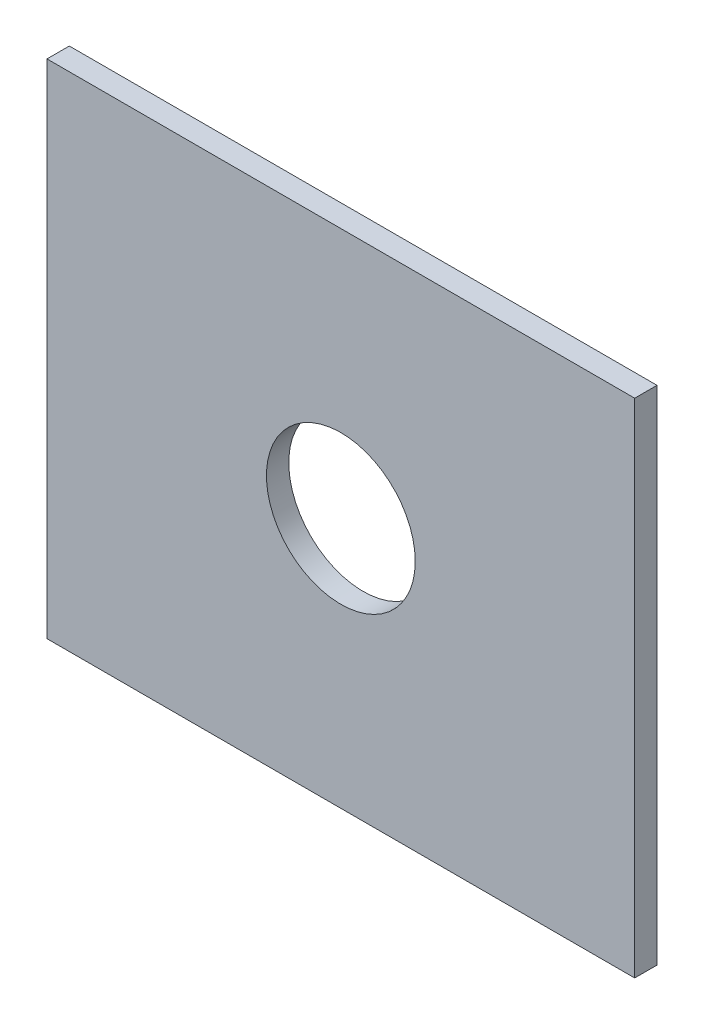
ISO-10303-21;
HEADER;
FILE_DESCRIPTION(('STEP AP214'),'2;1');
FILE_NAME('part.step','',(''),(''),'','','');
FILE_SCHEMA(('AUTOMOTIVE_DESIGN { 1 0 10303 214 1 1 1 1 }'));
ENDSEC;
DATA;
#1=APPLICATION_CONTEXT('core data for automotive mechanical design processes');
#2=APPLICATION_PROTOCOL_DEFINITION('international standard','automotive_design',2000,#1);
#3=PRODUCT_CONTEXT('',#1,'mechanical');
#4=PRODUCT('Part','Part','',(#3));
#5=PRODUCT_RELATED_PRODUCT_CATEGORY('part','',(#4));
#6=PRODUCT_DEFINITION_FORMATION('','',#4);
#7=PRODUCT_DEFINITION_CONTEXT('part definition',#1,'design');
#8=PRODUCT_DEFINITION('design','',#6,#7);
#9=PRODUCT_DEFINITION_SHAPE('','',#8);
#10=(LENGTH_UNIT() NAMED_UNIT(*) SI_UNIT(.MILLI.,.METRE.));
#11=(NAMED_UNIT(*) PLANE_ANGLE_UNIT() SI_UNIT($,.RADIAN.));
#12=(NAMED_UNIT(*) SI_UNIT($,.STERADIAN.) SOLID_ANGLE_UNIT());
#13=UNCERTAINTY_MEASURE_WITH_UNIT(LENGTH_MEASURE(1.E-05),#10,'distance_accuracy_value','');
#14=(GEOMETRIC_REPRESENTATION_CONTEXT(3) GLOBAL_UNCERTAINTY_ASSIGNED_CONTEXT((#13)) GLOBAL_UNIT_ASSIGNED_CONTEXT((#10,
#11,#12)) REPRESENTATION_CONTEXT('',''));
#15=CARTESIAN_POINT('',(0.,0.,0.));
#16=DIRECTION('',(0.,0.,1.));
#17=DIRECTION('',(1.,0.,0.));
#18=AXIS2_PLACEMENT_3D('',#15,#16,#17);
#19=CARTESIAN_POINT('',(-75.1547731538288,-72.4394327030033,6.));
#20=DIRECTION('',(0.,0.,1.));
#21=DIRECTION('',(1.,0.,0.));
#22=AXIS2_PLACEMENT_3D('',#19,#20,#21);
#23=PLANE('',#22);
#24=DIRECTION('',(0.,-1.,0.));
#25=VECTOR('',#24,1.);
#26=CARTESIAN_POINT('',(-75.1547731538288,62.5605672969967,6.));
#27=LINE('',#26,#25);
#28=CARTESIAN_POINT('',(-75.1547731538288,62.5605672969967,6.));
#29=VERTEX_POINT('',#28);
#30=CARTESIAN_POINT('',(-75.1547731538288,-72.4394327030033,6.));
#31=VERTEX_POINT('',#30);
#32=EDGE_CURVE('E83',#29,#31,#27,.T.);
#33=ORIENTED_EDGE('',*,*,#32,.T.);
#34=DIRECTION('',(1.,0.,0.));
#35=VECTOR('',#34,1.);
#36=CARTESIAN_POINT('',(-75.1547731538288,-72.4394327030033,6.));
#37=LINE('',#36,#35);
#38=CARTESIAN_POINT('',(82.8452268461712,-72.4394327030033,6.));
#39=VERTEX_POINT('',#38);
#40=EDGE_CURVE('E78',#31,#39,#37,.T.);
#41=ORIENTED_EDGE('',*,*,#40,.T.);
#42=DIRECTION('',(0.,1.,0.));
#43=VECTOR('',#42,1.);
#44=CARTESIAN_POINT('',(82.8452268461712,62.5605672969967,6.));
#45=LINE('',#44,#43);
#46=CARTESIAN_POINT('',(82.8452268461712,62.5605672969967,6.));
#47=VERTEX_POINT('',#46);
#48=EDGE_CURVE('E81',#39,#47,#45,.T.);
#49=ORIENTED_EDGE('',*,*,#48,.T.);
#50=DIRECTION('',(-1.,0.,0.));
#51=VECTOR('',#50,1.);
#52=CARTESIAN_POINT('',(-75.1547731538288,62.5605672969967,6.));
#53=LINE('',#52,#51);
#54=EDGE_CURVE('E48',#47,#29,#53,.T.);
#55=ORIENTED_EDGE('',*,*,#54,.T.);
#56=EDGE_LOOP('',(#33,#41,#49,#55));
#57=FACE_BOUND('',#56,.T.);
#58=CARTESIAN_POINT('',(3.84522684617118,-4.93943270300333,6.));
#59=DIRECTION('',(0.,0.,1.));
#60=DIRECTION('',(1.,0.,0.));
#61=AXIS2_PLACEMENT_3D('',#58,#59,#60);
#62=CIRCLE('',#61,20.);
#63=CARTESIAN_POINT('',(23.8452268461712,-4.93943270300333,6.));
#64=VERTEX_POINT('',#63);
#65=EDGE_CURVE('E98',#64,#64,#62,.T.);
#66=ORIENTED_EDGE('',*,*,#65,.F.);
#67=EDGE_LOOP('',(#66));
#68=FACE_BOUND('',#67,.T.);
#69=ADVANCED_FACE('F31',(#57,#68),#23,.T.);
#70=CARTESIAN_POINT('',(-75.1547731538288,-72.4394327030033,0.));
#71=DIRECTION('',(0.,0.,1.));
#72=DIRECTION('',(1.,0.,0.));
#73=AXIS2_PLACEMENT_3D('',#70,#71,#72);
#74=PLANE('',#73);
#75=DIRECTION('',(0.,-1.,0.));
#76=VECTOR('',#75,1.);
#77=CARTESIAN_POINT('',(-75.1547731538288,62.5605672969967,0.));
#78=LINE('',#77,#76);
#79=CARTESIAN_POINT('',(-75.1547731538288,62.5605672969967,0.));
#80=VERTEX_POINT('',#79);
#81=CARTESIAN_POINT('',(-75.1547731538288,-72.4394327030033,0.));
#82=VERTEX_POINT('',#81);
#83=EDGE_CURVE('E95',#80,#82,#78,.T.);
#84=ORIENTED_EDGE('',*,*,#83,.F.);
#85=DIRECTION('',(-1.,0.,0.));
#86=VECTOR('',#85,1.);
#87=CARTESIAN_POINT('',(-75.1547731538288,62.5605672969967,0.));
#88=LINE('',#87,#86);
#89=CARTESIAN_POINT('',(82.8452268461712,62.5605672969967,0.));
#90=VERTEX_POINT('',#89);
#91=EDGE_CURVE('E71',#90,#80,#88,.T.);
#92=ORIENTED_EDGE('',*,*,#91,.F.);
#93=DIRECTION('',(0.,1.,0.));
#94=VECTOR('',#93,1.);
#95=CARTESIAN_POINT('',(82.8452268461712,62.5605672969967,0.));
#96=LINE('',#95,#94);
#97=CARTESIAN_POINT('',(82.8452268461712,-72.4394327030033,0.));
#98=VERTEX_POINT('',#97);
#99=EDGE_CURVE('E65',#98,#90,#96,.T.);
#100=ORIENTED_EDGE('',*,*,#99,.F.);
#101=DIRECTION('',(1.,0.,0.));
#102=VECTOR('',#101,1.);
#103=CARTESIAN_POINT('',(-75.1547731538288,-72.4394327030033,0.));
#104=LINE('',#103,#102);
#105=EDGE_CURVE('E87',#82,#98,#104,.T.);
#106=ORIENTED_EDGE('',*,*,#105,.F.);
#107=EDGE_LOOP('',(#84,#92,#100,#106));
#108=FACE_BOUND('',#107,.T.);
#109=CARTESIAN_POINT('',(3.84522684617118,-4.93943270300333,0.));
#110=DIRECTION('',(0.,0.,1.));
#111=DIRECTION('',(1.,0.,0.));
#112=AXIS2_PLACEMENT_3D('',#109,#110,#111);
#113=CIRCLE('',#112,20.);
#114=CARTESIAN_POINT('',(23.8452268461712,-4.93943270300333,0.));
#115=VERTEX_POINT('',#114);
#116=EDGE_CURVE('E110',#115,#115,#113,.T.);
#117=ORIENTED_EDGE('',*,*,#116,.T.);
#118=EDGE_LOOP('',(#117));
#119=FACE_BOUND('',#118,.T.);
#120=ADVANCED_FACE('F106',(#108,#119),#74,.F.);
#121=CARTESIAN_POINT('',(-75.1547731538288,62.5605672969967,6.));
#122=DIRECTION('',(1.,0.,0.));
#123=DIRECTION('',(0.,1.,0.));
#124=AXIS2_PLACEMENT_3D('',#121,#122,#123);
#125=PLANE('',#124);
#126=ORIENTED_EDGE('',*,*,#83,.T.);
#127=DIRECTION('',(0.,0.,-1.));
#128=VECTOR('',#127,1.);
#129=CARTESIAN_POINT('',(-75.1547731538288,-72.4394327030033,6.));
#130=LINE('',#129,#128);
#131=EDGE_CURVE('E11',#31,#82,#130,.T.);
#132=ORIENTED_EDGE('',*,*,#131,.F.);
#133=ORIENTED_EDGE('',*,*,#32,.F.);
#134=DIRECTION('',(0.,0.,-1.));
#135=VECTOR('',#134,1.);
#136=CARTESIAN_POINT('',(-75.1547731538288,62.5605672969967,6.));
#137=LINE('',#136,#135);
#138=EDGE_CURVE('E91',#29,#80,#137,.T.);
#139=ORIENTED_EDGE('',*,*,#138,.T.);
#140=EDGE_LOOP('',(#126,#132,#133,#139));
#141=FACE_BOUND('',#140,.T.);
#142=ADVANCED_FACE('F33',(#141),#125,.F.);
#143=CARTESIAN_POINT('',(-75.1547731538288,-72.4394327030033,6.));
#144=DIRECTION('',(0.,1.,0.));
#145=DIRECTION('',(0.,0.,1.));
#146=AXIS2_PLACEMENT_3D('',#143,#144,#145);
#147=PLANE('',#146);
#148=ORIENTED_EDGE('',*,*,#105,.T.);
#149=DIRECTION('',(0.,0.,-1.));
#150=VECTOR('',#149,1.);
#151=CARTESIAN_POINT('',(82.8452268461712,-72.4394327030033,6.));
#152=LINE('',#151,#150);
#153=EDGE_CURVE('E40',#39,#98,#152,.T.);
#154=ORIENTED_EDGE('',*,*,#153,.F.);
#155=ORIENTED_EDGE('',*,*,#40,.F.);
#156=ORIENTED_EDGE('',*,*,#131,.T.);
#157=EDGE_LOOP('',(#148,#154,#155,#156));
#158=FACE_BOUND('',#157,.T.);
#159=ADVANCED_FACE('F86',(#158),#147,.F.);
#160=CARTESIAN_POINT('',(82.8452268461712,62.5605672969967,6.));
#161=DIRECTION('',(-1.,0.,0.));
#162=DIRECTION('',(0.,0.,1.));
#163=AXIS2_PLACEMENT_3D('',#160,#161,#162);
#164=PLANE('',#163);
#165=ORIENTED_EDGE('',*,*,#99,.T.);
#166=DIRECTION('',(0.,0.,-1.));
#167=VECTOR('',#166,1.);
#168=CARTESIAN_POINT('',(82.8452268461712,62.5605672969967,6.));
#169=LINE('',#168,#167);
#170=EDGE_CURVE('E88',#47,#90,#169,.T.);
#171=ORIENTED_EDGE('',*,*,#170,.F.);
#172=ORIENTED_EDGE('',*,*,#48,.F.);
#173=ORIENTED_EDGE('',*,*,#153,.T.);
#174=EDGE_LOOP('',(#165,#171,#172,#173));
#175=FACE_BOUND('',#174,.T.);
#176=ADVANCED_FACE('F89',(#175),#164,.F.);
#177=CARTESIAN_POINT('',(-75.1547731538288,62.5605672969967,6.));
#178=DIRECTION('',(0.,-1.,0.));
#179=DIRECTION('',(0.,0.,-1.));
#180=AXIS2_PLACEMENT_3D('',#177,#178,#179);
#181=PLANE('',#180);
#182=ORIENTED_EDGE('',*,*,#91,.T.);
#183=ORIENTED_EDGE('',*,*,#138,.F.);
#184=ORIENTED_EDGE('',*,*,#54,.F.);
#185=ORIENTED_EDGE('',*,*,#170,.T.);
#186=EDGE_LOOP('',(#182,#183,#184,#185));
#187=FACE_BOUND('',#186,.T.);
#188=ADVANCED_FACE('F103',(#187),#181,.F.);
#189=CARTESIAN_POINT('',(3.84522684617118,-4.93943270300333,6.));
#190=DIRECTION('',(0.,0.,-1.));
#191=DIRECTION('',(-1.,0.,0.));
#192=AXIS2_PLACEMENT_3D('',#189,#190,#191);
#193=CYLINDRICAL_SURFACE('',#192,20.);
#194=ORIENTED_EDGE('',*,*,#65,.T.);
#195=EDGE_LOOP('',(#194));
#196=FACE_BOUND('',#195,.T.);
#197=ORIENTED_EDGE('',*,*,#116,.F.);
#198=EDGE_LOOP('',(#197));
#199=FACE_BOUND('',#198,.T.);
#200=ADVANCED_FACE('F116',(#196,#199),#193,.F.);
#201=CLOSED_SHELL('',(#69,#120,#142,#159,#176,#188,#200));
#202=MANIFOLD_SOLID_BREP('B2',#201);
#203=ADVANCED_BREP_SHAPE_REPRESENTATION('',(#18,#202),#14);
#204=SHAPE_DEFINITION_REPRESENTATION(#9,#203);
ENDSEC;
END-ISO-10303-21;
